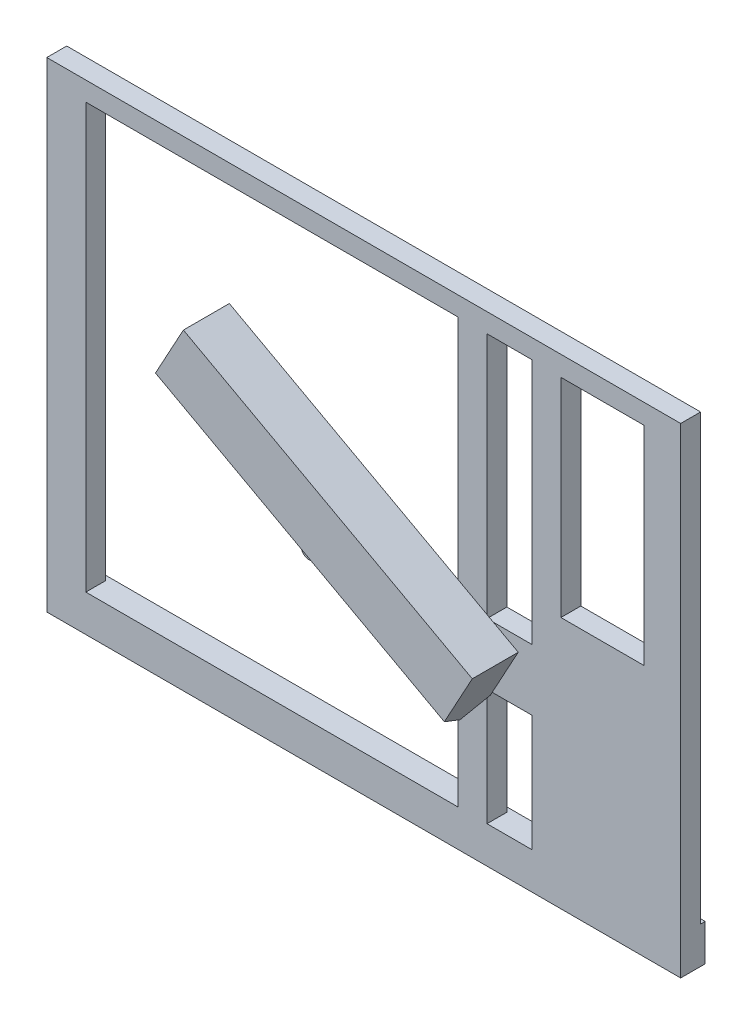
ISO-10303-21;
HEADER;
FILE_DESCRIPTION(('STEP AP214'),'2;1');
FILE_NAME('part.step','',(''),(''),'','','');
FILE_SCHEMA(('AUTOMOTIVE_DESIGN { 1 0 10303 214 1 1 1 1 }'));
ENDSEC;
DATA;
#1=APPLICATION_CONTEXT('core data for automotive mechanical design processes');
#2=APPLICATION_PROTOCOL_DEFINITION('international standard','automotive_design',2000,#1);
#3=PRODUCT_CONTEXT('',#1,'mechanical');
#4=PRODUCT('Part','Part','',(#3));
#5=PRODUCT_RELATED_PRODUCT_CATEGORY('part','',(#4));
#6=PRODUCT_DEFINITION_FORMATION('','',#4);
#7=PRODUCT_DEFINITION_CONTEXT('part definition',#1,'design');
#8=PRODUCT_DEFINITION('design','',#6,#7);
#9=PRODUCT_DEFINITION_SHAPE('','',#8);
#10=(LENGTH_UNIT() NAMED_UNIT(*) SI_UNIT(.MILLI.,.METRE.));
#11=(NAMED_UNIT(*) PLANE_ANGLE_UNIT() SI_UNIT($,.RADIAN.));
#12=(NAMED_UNIT(*) SI_UNIT($,.STERADIAN.) SOLID_ANGLE_UNIT());
#13=UNCERTAINTY_MEASURE_WITH_UNIT(LENGTH_MEASURE(1.E-05),#10,'distance_accuracy_value','');
#14=(GEOMETRIC_REPRESENTATION_CONTEXT(3) GLOBAL_UNCERTAINTY_ASSIGNED_CONTEXT((#13)) GLOBAL_UNIT_ASSIGNED_CONTEXT((#10,
#11,#12)) REPRESENTATION_CONTEXT('',''));
#15=CARTESIAN_POINT('',(0.,0.,0.));
#16=DIRECTION('',(0.,0.,1.));
#17=DIRECTION('',(1.,0.,0.));
#18=AXIS2_PLACEMENT_3D('',#15,#16,#17);
#19=CARTESIAN_POINT('',(-26.1560113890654,1126.92529325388,596.9));
#20=DIRECTION('',(0.,0.,1.));
#21=DIRECTION('',(1.,0.,0.));
#22=AXIS2_PLACEMENT_3D('',#19,#20,#21);
#23=CYLINDRICAL_SURFACE('',#22,6.24634409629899);
#24=DIRECTION('',(0.,0.,1.));
#25=VECTOR('',#24,1.);
#26=CARTESIAN_POINT('',(-20.6723495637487,1123.934262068,596.9));
#27=LINE('',#26,#25);
#28=CARTESIAN_POINT('',(-20.6723495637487,1123.934262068,596.9));
#29=VERTEX_POINT('',#28);
#30=CARTESIAN_POINT('',(-20.6723495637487,1123.934262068,609.6));
#31=VERTEX_POINT('',#30);
#32=EDGE_CURVE('E56',#29,#31,#27,.T.);
#33=ORIENTED_EDGE('',*,*,#32,.T.);
#34=CARTESIAN_POINT('',(-26.1560113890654,1126.92529325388,609.6));
#35=DIRECTION('',(0.,0.,1.));
#36=DIRECTION('',(1.,0.,0.));
#37=AXIS2_PLACEMENT_3D('',#34,#35,#36);
#38=CIRCLE('',#37,6.24634409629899);
#39=CARTESIAN_POINT('',(-24.6180914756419,1120.87123536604,609.6));
#40=VERTEX_POINT('',#39);
#41=EDGE_CURVE('E120',#31,#40,#38,.F.);
#42=ORIENTED_EDGE('',*,*,#41,.T.);
#43=DIRECTION('',(0.,0.,1.));
#44=VECTOR('',#43,1.);
#45=CARTESIAN_POINT('',(-24.6180914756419,1120.87123536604,596.9));
#46=LINE('',#45,#44);
#47=CARTESIAN_POINT('',(-24.6180914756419,1120.87123536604,596.9));
#48=VERTEX_POINT('',#47);
#49=EDGE_CURVE('E12',#48,#40,#46,.T.);
#50=ORIENTED_EDGE('',*,*,#49,.F.);
#51=CARTESIAN_POINT('',(-26.1560113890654,1126.92529325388,596.9));
#52=DIRECTION('',(0.,0.,1.));
#53=DIRECTION('',(1.,0.,0.));
#54=AXIS2_PLACEMENT_3D('',#51,#52,#53);
#55=CIRCLE('',#54,6.24634409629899);
#56=EDGE_CURVE('E69',#29,#48,#55,.F.);
#57=ORIENTED_EDGE('',*,*,#56,.F.);
#58=EDGE_LOOP('',(#33,#42,#50,#57));
#59=FACE_BOUND('',#58,.T.);
#60=ADVANCED_FACE('F53',(#59),#23,.T.);
#61=CARTESIAN_POINT('',(-268.9679684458,1058.79872985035,596.9));
#62=DIRECTION('',(0.246211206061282,-0.969216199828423,0.));
#63=DIRECTION('',(0.969216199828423,0.246211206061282,0.));
#64=AXIS2_PLACEMENT_3D('',#61,#62,#63);
#65=PLANE('',#64);
#66=ORIENTED_EDGE('',*,*,#49,.T.);
#67=DIRECTION('',(0.969216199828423,0.246211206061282,0.));
#68=VECTOR('',#67,1.);
#69=CARTESIAN_POINT('',(-268.9679684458,1058.79872985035,609.6));
#70=LINE('',#69,#68);
#71=CARTESIAN_POINT('',(-81.5535961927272,1106.40783773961,609.6));
#72=VERTEX_POINT('',#71);
#73=EDGE_CURVE('E135',#72,#40,#70,.T.);
#74=ORIENTED_EDGE('',*,*,#73,.F.);
#75=DIRECTION('',(0.,0.,1.));
#76=VECTOR('',#75,1.);
#77=CARTESIAN_POINT('',(-81.5535961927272,1106.40783773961,596.9));
#78=LINE('',#77,#76);
#79=CARTESIAN_POINT('',(-81.5535961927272,1106.40783773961,596.9));
#80=VERTEX_POINT('',#79);
#81=EDGE_CURVE('E61',#80,#72,#78,.T.);
#82=ORIENTED_EDGE('',*,*,#81,.F.);
#83=DIRECTION('',(0.969216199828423,0.246211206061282,0.));
#84=VECTOR('',#83,1.);
#85=CARTESIAN_POINT('',(-268.9679684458,1058.79872985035,596.9));
#86=LINE('',#85,#84);
#87=EDGE_CURVE('E174',#80,#48,#86,.T.);
#88=ORIENTED_EDGE('',*,*,#87,.T.);
#89=EDGE_LOOP('',(#66,#74,#82,#88));
#90=FACE_BOUND('',#89,.T.);
#91=ADVANCED_FACE('F207',(#90),#65,.T.);
#92=CARTESIAN_POINT('',(-89.6834902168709,1138.41135665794,596.9));
#93=DIRECTION('',(0.,0.,1.));
#94=DIRECTION('',(1.,0.,0.));
#95=AXIS2_PLACEMENT_3D('',#92,#93,#94);
#96=CYLINDRICAL_SURFACE('',#95,33.0200000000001);
#97=ORIENTED_EDGE('',*,*,#81,.T.);
#98=CARTESIAN_POINT('',(-89.6834902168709,1138.41135665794,609.6));
#99=DIRECTION('',(0.,0.,1.));
#100=DIRECTION('',(1.,0.,0.));
#101=AXIS2_PLACEMENT_3D('',#98,#99,#100);
#102=CIRCLE('',#101,33.0200000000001);
#103=CARTESIAN_POINT('',(-120.992274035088,1127.91943329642,609.6));
#104=VERTEX_POINT('',#103);
#105=EDGE_CURVE('E152',#104,#72,#102,.T.);
#106=ORIENTED_EDGE('',*,*,#105,.F.);
#107=DIRECTION('',(0.,0.,1.));
#108=VECTOR('',#107,1.);
#109=CARTESIAN_POINT('',(-120.992274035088,1127.91943329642,596.9));
#110=LINE('',#109,#108);
#111=CARTESIAN_POINT('',(-120.992274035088,1127.91943329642,596.9));
#112=VERTEX_POINT('',#111);
#113=EDGE_CURVE('E179',#112,#104,#110,.T.);
#114=ORIENTED_EDGE('',*,*,#113,.F.);
#115=CARTESIAN_POINT('',(-89.6834902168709,1138.41135665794,596.9));
#116=DIRECTION('',(0.,0.,1.));
#117=DIRECTION('',(1.,0.,0.));
#118=AXIS2_PLACEMENT_3D('',#115,#116,#117);
#119=CIRCLE('',#118,33.0200000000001);
#120=EDGE_CURVE('E172',#112,#80,#119,.T.);
#121=ORIENTED_EDGE('',*,*,#120,.T.);
#122=EDGE_LOOP('',(#97,#106,#114,#121));
#123=FACE_BOUND('',#122,.T.);
#124=ADVANCED_FACE('F205',(#123),#96,.T.);
#125=CARTESIAN_POINT('',(231.040410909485,77.4242237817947,596.9));
#126=DIRECTION('',(-0.948176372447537,-0.317744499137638,0.));
#127=DIRECTION('',(0.317744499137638,-0.948176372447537,0.));
#128=AXIS2_PLACEMENT_3D('',#125,#126,#127);
#129=PLANE('',#128);
#130=ORIENTED_EDGE('',*,*,#113,.T.);
#131=DIRECTION('',(0.317744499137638,-0.948176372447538,0.));
#132=VECTOR('',#131,1.);
#133=CARTESIAN_POINT('',(231.040410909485,77.4242237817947,609.6));
#134=LINE('',#133,#132);
#135=CARTESIAN_POINT('',(-139.657813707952,1183.61897725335,609.6));
#136=VERTEX_POINT('',#135);
#137=EDGE_CURVE('E149',#136,#104,#134,.T.);
#138=ORIENTED_EDGE('',*,*,#137,.F.);
#139=DIRECTION('',(0.,0.,1.));
#140=VECTOR('',#139,1.);
#141=CARTESIAN_POINT('',(-139.657813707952,1183.61897725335,596.9));
#142=LINE('',#141,#140);
#143=CARTESIAN_POINT('',(-139.657813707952,1183.61897725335,596.9));
#144=VERTEX_POINT('',#143);
#145=EDGE_CURVE('E181',#144,#136,#142,.T.);
#146=ORIENTED_EDGE('',*,*,#145,.F.);
#147=DIRECTION('',(0.317744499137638,-0.948176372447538,0.));
#148=VECTOR('',#147,1.);
#149=CARTESIAN_POINT('',(231.040410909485,77.4242237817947,596.9));
#150=LINE('',#149,#148);
#151=EDGE_CURVE('E169',#144,#112,#150,.T.);
#152=ORIENTED_EDGE('',*,*,#151,.T.);
#153=EDGE_LOOP('',(#130,#138,#146,#152));
#154=FACE_BOUND('',#153,.T.);
#155=ADVANCED_FACE('F200',(#154),#129,.T.);
#156=CARTESIAN_POINT('',(-133.735177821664,1185.60371872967,596.9));
#157=DIRECTION('',(0.,0.,1.));
#158=DIRECTION('',(1.,0.,0.));
#159=AXIS2_PLACEMENT_3D('',#156,#157,#158);
#160=CYLINDRICAL_SURFACE('',#159,6.2463440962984);
#161=ORIENTED_EDGE('',*,*,#145,.T.);
#162=CARTESIAN_POINT('',(-133.735177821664,1185.60371872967,609.6));
#163=DIRECTION('',(0.,0.,1.));
#164=DIRECTION('',(1.,0.,0.));
#165=AXIS2_PLACEMENT_3D('',#162,#163,#164);
#166=CIRCLE('',#165,6.2463440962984);
#167=CARTESIAN_POINT('',(-139.21883964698,1188.59474991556,609.6));
#168=VERTEX_POINT('',#167);
#169=EDGE_CURVE('E146',#168,#136,#166,.T.);
#170=ORIENTED_EDGE('',*,*,#169,.F.);
#171=DIRECTION('',(0.,0.,1.));
#172=VECTOR('',#171,1.);
#173=CARTESIAN_POINT('',(-139.21883964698,1188.59474991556,596.9));
#174=LINE('',#173,#172);
#175=CARTESIAN_POINT('',(-139.21883964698,1188.59474991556,596.9));
#176=VERTEX_POINT('',#175);
#177=EDGE_CURVE('E183',#176,#168,#174,.T.);
#178=ORIENTED_EDGE('',*,*,#177,.F.);
#179=CARTESIAN_POINT('',(-133.735177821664,1185.60371872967,596.9));
#180=DIRECTION('',(0.,0.,1.));
#181=DIRECTION('',(1.,0.,0.));
#182=AXIS2_PLACEMENT_3D('',#179,#180,#181);
#183=CIRCLE('',#182,6.2463440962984);
#184=EDGE_CURVE('E166',#176,#144,#183,.T.);
#185=ORIENTED_EDGE('',*,*,#184,.T.);
#186=EDGE_LOOP('',(#161,#170,#178,#185));
#187=FACE_BOUND('',#186,.T.);
#188=ADVANCED_FACE('F196',(#187),#160,.T.);
#189=CARTESIAN_POINT('',(-606.955859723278,331.060514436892,596.9));
#190=DIRECTION('',(-0.877899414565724,0.478845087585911,0.));
#191=DIRECTION('',(-0.478845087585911,-0.877899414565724,0.));
#192=AXIS2_PLACEMENT_3D('',#189,#190,#191);
#193=PLANE('',#192);
#194=ORIENTED_EDGE('',*,*,#177,.T.);
#195=DIRECTION('',(-0.478845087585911,-0.877899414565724,0.));
#196=VECTOR('',#195,1.);
#197=CARTESIAN_POINT('',(-606.955859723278,331.060514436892,609.6));
#198=LINE('',#197,#196);
#199=CARTESIAN_POINT('',(-133.137507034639,1199.74407248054,609.6));
#200=VERTEX_POINT('',#199);
#201=EDGE_CURVE('E141',#200,#168,#198,.T.);
#202=ORIENTED_EDGE('',*,*,#201,.F.);
#203=DIRECTION('',(0.,0.,1.));
#204=VECTOR('',#203,1.);
#205=CARTESIAN_POINT('',(-133.137507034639,1199.74407248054,596.9));
#206=LINE('',#205,#204);
#207=CARTESIAN_POINT('',(-133.137507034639,1199.74407248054,596.9));
#208=VERTEX_POINT('',#207);
#209=EDGE_CURVE('E185',#208,#200,#206,.T.);
#210=ORIENTED_EDGE('',*,*,#209,.F.);
#211=DIRECTION('',(-0.478845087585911,-0.877899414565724,0.));
#212=VECTOR('',#211,1.);
#213=CARTESIAN_POINT('',(-606.955859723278,331.060514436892,596.9));
#214=LINE('',#213,#212);
#215=EDGE_CURVE('E163',#208,#176,#214,.T.);
#216=ORIENTED_EDGE('',*,*,#215,.T.);
#217=EDGE_LOOP('',(#194,#202,#210,#216));
#218=FACE_BOUND('',#217,.T.);
#219=ADVANCED_FACE('F192',(#218),#193,.T.);
#220=CARTESIAN_POINT('',(473.818352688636,868.683558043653,596.9));
#221=DIRECTION('',(-0.478845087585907,-0.877899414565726,0.));
#222=DIRECTION('',(0.877899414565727,-0.478845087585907,0.));
#223=AXIS2_PLACEMENT_3D('',#220,#221,#222);
#224=PLANE('',#223);
#225=ORIENTED_EDGE('',*,*,#209,.T.);
#226=DIRECTION('',(0.877899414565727,-0.478845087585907,0.));
#227=VECTOR('',#226,1.);
#228=CARTESIAN_POINT('',(473.818352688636,868.683558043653,609.6));
#229=LINE('',#228,#227);
#230=CARTESIAN_POINT('',(-14.5910169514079,1135.08358463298,609.6));
#231=VERTEX_POINT('',#230);
#232=EDGE_CURVE('E139',#200,#231,#229,.T.);
#233=ORIENTED_EDGE('',*,*,#232,.T.);
#234=DIRECTION('',(0.,0.,1.));
#235=VECTOR('',#234,1.);
#236=CARTESIAN_POINT('',(-14.5910169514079,1135.08358463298,596.9));
#237=LINE('',#236,#235);
#238=CARTESIAN_POINT('',(-14.5910169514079,1135.08358463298,596.9));
#239=VERTEX_POINT('',#238);
#240=EDGE_CURVE('E124',#239,#231,#237,.T.);
#241=ORIENTED_EDGE('',*,*,#240,.F.);
#242=DIRECTION('',(0.877899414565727,-0.478845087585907,0.));
#243=VECTOR('',#242,1.);
#244=CARTESIAN_POINT('',(473.818352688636,868.683558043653,596.9));
#245=LINE('',#244,#243);
#246=EDGE_CURVE('E161',#208,#239,#245,.T.);
#247=ORIENTED_EDGE('',*,*,#246,.F.);
#248=EDGE_LOOP('',(#225,#233,#241,#247));
#249=FACE_BOUND('',#248,.T.);
#250=ADVANCED_FACE('F189',(#249),#224,.F.);
#251=CARTESIAN_POINT('',(-488.409369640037,266.400026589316,596.9));
#252=DIRECTION('',(-0.877899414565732,0.478845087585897,0.));
#253=DIRECTION('',(-0.478845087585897,-0.877899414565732,0.));
#254=AXIS2_PLACEMENT_3D('',#251,#252,#253);
#255=PLANE('',#254);
#256=ORIENTED_EDGE('',*,*,#240,.T.);
#257=DIRECTION('',(-0.478845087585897,-0.877899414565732,0.));
#258=VECTOR('',#257,1.);
#259=CARTESIAN_POINT('',(-488.409369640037,266.400026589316,609.6));
#260=LINE('',#259,#258);
#261=EDGE_CURVE('E132',#231,#31,#260,.T.);
#262=ORIENTED_EDGE('',*,*,#261,.T.);
#263=ORIENTED_EDGE('',*,*,#32,.F.);
#264=DIRECTION('',(-0.478845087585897,-0.877899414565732,0.));
#265=VECTOR('',#264,1.);
#266=CARTESIAN_POINT('',(-488.409369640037,266.400026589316,596.9));
#267=LINE('',#266,#265);
#268=EDGE_CURVE('E159',#239,#29,#267,.T.);
#269=ORIENTED_EDGE('',*,*,#268,.F.);
#270=EDGE_LOOP('',(#256,#262,#263,#269));
#271=FACE_BOUND('',#270,.T.);
#272=ADVANCED_FACE('F137',(#271),#255,.F.);
#273=CARTESIAN_POINT('',(-89.6834902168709,1138.41135665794,596.9));
#274=DIRECTION('',(0.,0.,1.));
#275=DIRECTION('',(1.,0.,0.));
#276=AXIS2_PLACEMENT_3D('',#273,#274,#275);
#277=CYLINDRICAL_SURFACE('',#276,19.0499999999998);
#278=CARTESIAN_POINT('',(-89.6834902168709,1138.41135665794,596.9));
#279=DIRECTION('',(0.,0.,1.));
#280=DIRECTION('',(1.,0.,0.));
#281=AXIS2_PLACEMENT_3D('',#278,#279,#280);
#282=CIRCLE('',#281,19.0499999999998);
#283=CARTESIAN_POINT('',(-70.633490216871,1138.41135665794,596.9));
#284=VERTEX_POINT('',#283);
#285=EDGE_CURVE('E125',#284,#284,#282,.T.);
#286=ORIENTED_EDGE('',*,*,#285,.F.);
#287=EDGE_LOOP('',(#286));
#288=FACE_BOUND('',#287,.T.);
#289=CARTESIAN_POINT('',(-89.6834902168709,1138.41135665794,609.6));
#290=DIRECTION('',(0.,0.,1.));
#291=DIRECTION('',(1.,0.,0.));
#292=AXIS2_PLACEMENT_3D('',#289,#290,#291);
#293=CIRCLE('',#292,19.0499999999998);
#294=CARTESIAN_POINT('',(-70.633490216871,1138.41135665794,609.6));
#295=VERTEX_POINT('',#294);
#296=EDGE_CURVE('E155',#295,#295,#293,.T.);
#297=ORIENTED_EDGE('',*,*,#296,.T.);
#298=EDGE_LOOP('',(#297));
#299=FACE_BOUND('',#298,.T.);
#300=ADVANCED_FACE('F216',(#288,#299),#277,.F.);
#301=CARTESIAN_POINT('',(0.,0.,596.9));
#302=DIRECTION('',(0.,0.,1.));
#303=DIRECTION('',(1.,0.,0.));
#304=AXIS2_PLACEMENT_3D('',#301,#302,#303);
#305=PLANE('',#304);
#306=ORIENTED_EDGE('',*,*,#56,.T.);
#307=ORIENTED_EDGE('',*,*,#87,.F.);
#308=ORIENTED_EDGE('',*,*,#120,.F.);
#309=ORIENTED_EDGE('',*,*,#151,.F.);
#310=ORIENTED_EDGE('',*,*,#184,.F.);
#311=ORIENTED_EDGE('',*,*,#215,.F.);
#312=ORIENTED_EDGE('',*,*,#246,.T.);
#313=ORIENTED_EDGE('',*,*,#268,.T.);
#314=EDGE_LOOP('',(#306,#307,#308,#309,#310,#311,#312,#313));
#315=FACE_BOUND('',#314,.T.);
#316=ORIENTED_EDGE('',*,*,#285,.T.);
#317=EDGE_LOOP('',(#316));
#318=FACE_BOUND('',#317,.T.);
#319=ADVANCED_FACE('F202',(#315,#318),#305,.F.);
#320=CARTESIAN_POINT('',(0.,0.,609.6));
#321=DIRECTION('',(0.,0.,1.));
#322=DIRECTION('',(1.,0.,0.));
#323=AXIS2_PLACEMENT_3D('',#320,#321,#322);
#324=PLANE('',#323);
#325=ORIENTED_EDGE('',*,*,#41,.F.);
#326=ORIENTED_EDGE('',*,*,#261,.F.);
#327=ORIENTED_EDGE('',*,*,#232,.F.);
#328=ORIENTED_EDGE('',*,*,#201,.T.);
#329=ORIENTED_EDGE('',*,*,#169,.T.);
#330=ORIENTED_EDGE('',*,*,#137,.T.);
#331=ORIENTED_EDGE('',*,*,#105,.T.);
#332=ORIENTED_EDGE('',*,*,#73,.T.);
#333=EDGE_LOOP('',(#325,#326,#327,#328,#329,#330,#331,#332));
#334=FACE_BOUND('',#333,.T.);
#335=ORIENTED_EDGE('',*,*,#296,.F.);
#336=EDGE_LOOP('',(#335));
#337=FACE_BOUND('',#336,.T.);
#338=ADVANCED_FACE('F129',(#334,#337),#324,.T.);
#339=CLOSED_SHELL('',(#60,#91,#124,#155,#188,#219,#250,#272,#300,#319,#338));
#340=MANIFOLD_SOLID_BREP('B2_NOT_SHOWN',#339);
#341=CARTESIAN_POINT('',(-521.836401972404,1758.95,698.5));
#342=DIRECTION('',(-0.877899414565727,0.478845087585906,0.));
#343=DIRECTION('',(-0.478845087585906,-0.877899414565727,0.));
#344=AXIS2_PLACEMENT_3D('',#341,#342,#343);
#345=PLANE('',#344);
#346=DIRECTION('',(-0.264691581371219,-0.485277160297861,0.833333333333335));
#347=VECTOR('',#346,1.);
#348=CARTESIAN_POINT('',(-637.534136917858,1546.83343786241,508.));
#349=LINE('',#348,#347);
#350=CARTESIAN_POINT('',(-637.534136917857,1546.83343786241,508.));
#351=VERTEX_POINT('',#350);
#352=CARTESIAN_POINT('',(-667.788384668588,1491.36625844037,603.25));
#353=VERTEX_POINT('',#352);
#354=EDGE_CURVE('E325',#351,#353,#349,.T.);
#355=ORIENTED_EDGE('',*,*,#354,.T.);
#356=DIRECTION('',(0.264691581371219,0.485277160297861,0.833333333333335));
#357=VECTOR('',#356,1.);
#358=CARTESIAN_POINT('',(-667.788384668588,1491.36625844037,603.25));
#359=LINE('',#358,#357);
#360=CARTESIAN_POINT('',(-637.534136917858,1546.83343786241,698.5));
#361=VERTEX_POINT('',#360);
#362=EDGE_CURVE('E377',#353,#361,#359,.T.);
#363=ORIENTED_EDGE('',*,*,#362,.T.);
#364=DIRECTION('',(0.478845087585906,0.877899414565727,0.));
#365=VECTOR('',#364,1.);
#366=CARTESIAN_POINT('',(-521.836401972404,1758.95,698.5));
#367=LINE('',#366,#365);
#368=CARTESIAN_POINT('',(-521.836401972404,1758.95,698.5));
#369=VERTEX_POINT('',#368);
#370=EDGE_CURVE('E360',#361,#369,#367,.T.);
#371=ORIENTED_EDGE('',*,*,#370,.T.);
#372=DIRECTION('',(0.,0.,-1.));
#373=VECTOR('',#372,1.);
#374=CARTESIAN_POINT('',(-521.836401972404,1758.95,698.5));
#375=LINE('',#374,#373);
#376=CARTESIAN_POINT('',(-521.836401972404,1758.95,508.));
#377=VERTEX_POINT('',#376);
#378=EDGE_CURVE('E314',#369,#377,#375,.T.);
#379=ORIENTED_EDGE('',*,*,#378,.T.);
#380=DIRECTION('',(0.478845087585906,0.877899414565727,0.));
#381=VECTOR('',#380,1.);
#382=CARTESIAN_POINT('',(-521.836401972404,1758.95,508.));
#383=LINE('',#382,#381);
#384=EDGE_CURVE('E364',#351,#377,#383,.T.);
#385=ORIENTED_EDGE('',*,*,#384,.F.);
#386=EDGE_LOOP('',(#355,#363,#371,#379,#385));
#387=FACE_BOUND('',#386,.T.);
#388=ADVANCED_FACE('F311',(#387),#345,.T.);
#389=CARTESIAN_POINT('',(529.705942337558,838.2,698.5));
#390=DIRECTION('',(0.877899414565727,-0.478845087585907,0.));
#391=DIRECTION('',(0.478845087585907,0.877899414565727,0.));
#392=AXIS2_PLACEMENT_3D('',#389,#390,#391);
#393=PLANE('',#392);
#394=DIRECTION('',(-0.264691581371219,-0.485277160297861,-0.833333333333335));
#395=VECTOR('',#394,1.);
#396=CARTESIAN_POINT('',(529.705942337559,838.2,603.25));
#397=LINE('',#396,#395);
#398=CARTESIAN_POINT('',(559.960190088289,893.667179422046,698.5));
#399=VERTEX_POINT('',#398);
#400=CARTESIAN_POINT('',(529.705942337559,838.2,603.25));
#401=VERTEX_POINT('',#400);
#402=EDGE_CURVE('E378',#399,#401,#397,.T.);
#403=ORIENTED_EDGE('',*,*,#402,.T.);
#404=DIRECTION('',(0.264691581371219,0.485277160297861,-0.833333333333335));
#405=VECTOR('',#404,1.);
#406=CARTESIAN_POINT('',(559.960190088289,893.667179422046,508.));
#407=LINE('',#406,#405);
#408=CARTESIAN_POINT('',(559.960190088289,893.667179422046,508.));
#409=VERTEX_POINT('',#408);
#410=EDGE_CURVE('E358',#401,#409,#407,.T.);
#411=ORIENTED_EDGE('',*,*,#410,.T.);
#412=DIRECTION('',(-0.478845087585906,-0.877899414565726,0.));
#413=VECTOR('',#412,1.);
#414=CARTESIAN_POINT('',(529.705942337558,838.2,508.));
#415=LINE('',#414,#413);
#416=CARTESIAN_POINT('',(675.657925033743,1105.78374155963,508.));
#417=VERTEX_POINT('',#416);
#418=EDGE_CURVE('E353',#417,#409,#415,.T.);
#419=ORIENTED_EDGE('',*,*,#418,.F.);
#420=DIRECTION('',(0.,0.,-1.));
#421=VECTOR('',#420,1.);
#422=CARTESIAN_POINT('',(675.657925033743,1105.78374155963,698.5));
#423=LINE('',#422,#421);
#424=CARTESIAN_POINT('',(675.657925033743,1105.78374155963,698.5));
#425=VERTEX_POINT('',#424);
#426=EDGE_CURVE('E51',#425,#417,#423,.T.);
#427=ORIENTED_EDGE('',*,*,#426,.F.);
#428=DIRECTION('',(-0.478845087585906,-0.877899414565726,0.));
#429=VECTOR('',#428,1.);
#430=CARTESIAN_POINT('',(529.705942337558,838.2,698.5));
#431=LINE('',#430,#429);
#432=EDGE_CURVE('E369',#425,#399,#431,.T.);
#433=ORIENTED_EDGE('',*,*,#432,.T.);
#434=EDGE_LOOP('',(#403,#411,#419,#427,#433));
#435=FACE_BOUND('',#434,.T.);
#436=ADVANCED_FACE('F355',(#435),#393,.T.);
#437=CARTESIAN_POINT('',(675.657925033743,1105.78374155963,698.5));
#438=DIRECTION('',(0.478845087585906,0.877899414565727,0.));
#439=DIRECTION('',(-0.877899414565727,0.478845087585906,0.));
#440=AXIS2_PLACEMENT_3D('',#437,#438,#439);
#441=PLANE('',#440);
#442=DIRECTION('',(0.877899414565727,-0.478845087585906,0.));
#443=VECTOR('',#442,1.);
#444=CARTESIAN_POINT('',(675.657925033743,1105.78374155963,508.));
#445=LINE('',#444,#443);
#446=EDGE_CURVE('E348',#377,#417,#445,.T.);
#447=ORIENTED_EDGE('',*,*,#446,.F.);
#448=ORIENTED_EDGE('',*,*,#378,.F.);
#449=DIRECTION('',(0.877899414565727,-0.478845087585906,0.));
#450=VECTOR('',#449,1.);
#451=CARTESIAN_POINT('',(675.657925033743,1105.78374155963,698.5));
#452=LINE('',#451,#450);
#453=EDGE_CURVE('E350',#369,#425,#452,.T.);
#454=ORIENTED_EDGE('',*,*,#453,.T.);
#455=ORIENTED_EDGE('',*,*,#426,.T.);
#456=EDGE_LOOP('',(#447,#448,#454,#455));
#457=FACE_BOUND('',#456,.T.);
#458=ADVANCED_FACE('F345',(#457),#441,.T.);
#459=CARTESIAN_POINT('',(0.,0.,698.5));
#460=DIRECTION('',(0.,0.,1.));
#461=DIRECTION('',(1.,0.,0.));
#462=AXIS2_PLACEMENT_3D('',#459,#460,#461);
#463=PLANE('',#462);
#464=DIRECTION('',(-0.877899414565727,0.478845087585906,0.));
#465=VECTOR('',#464,1.);
#466=CARTESIAN_POINT('',(572.05488279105,887.070200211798,698.5));
#467=LINE('',#466,#465);
#468=EDGE_CURVE('E379',#399,#361,#467,.T.);
#469=ORIENTED_EDGE('',*,*,#468,.F.);
#470=ORIENTED_EDGE('',*,*,#432,.F.);
#471=ORIENTED_EDGE('',*,*,#453,.F.);
#472=ORIENTED_EDGE('',*,*,#370,.F.);
#473=EDGE_LOOP('',(#469,#470,#471,#472));
#474=FACE_BOUND('',#473,.T.);
#475=ADVANCED_FACE('F402',(#474),#463,.T.);
#476=CARTESIAN_POINT('',(0.,0.,508.));
#477=DIRECTION('',(0.,0.,1.));
#478=DIRECTION('',(1.,0.,0.));
#479=AXIS2_PLACEMENT_3D('',#476,#477,#478);
#480=PLANE('',#479);
#481=ORIENTED_EDGE('',*,*,#418,.T.);
#482=DIRECTION('',(-0.877899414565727,0.478845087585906,0.));
#483=VECTOR('',#482,1.);
#484=CARTESIAN_POINT('',(572.05488279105,887.070200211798,508.));
#485=LINE('',#484,#483);
#486=EDGE_CURVE('E373',#409,#351,#485,.T.);
#487=ORIENTED_EDGE('',*,*,#486,.T.);
#488=ORIENTED_EDGE('',*,*,#384,.T.);
#489=ORIENTED_EDGE('',*,*,#446,.T.);
#490=EDGE_LOOP('',(#481,#487,#488,#489));
#491=FACE_BOUND('',#490,.T.);
#492=ADVANCED_FACE('F362',(#491),#480,.F.);
#493=CARTESIAN_POINT('',(541.80063504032,831.603020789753,603.25));
#494=DIRECTION('',(0.399037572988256,0.731582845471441,-0.552770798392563));
#495=DIRECTION('',(0.,0.602846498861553,0.797857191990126));
#496=AXIS2_PLACEMENT_3D('',#493,#494,#495);
#497=PLANE('',#496);
#498=ORIENTED_EDGE('',*,*,#468,.T.);
#499=ORIENTED_EDGE('',*,*,#362,.F.);
#500=DIRECTION('',(-0.877899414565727,0.478845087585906,0.));
#501=VECTOR('',#500,1.);
#502=CARTESIAN_POINT('',(541.80063504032,831.603020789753,603.25));
#503=LINE('',#502,#501);
#504=EDGE_CURVE('E375',#401,#353,#503,.T.);
#505=ORIENTED_EDGE('',*,*,#504,.F.);
#506=ORIENTED_EDGE('',*,*,#402,.F.);
#507=EDGE_LOOP('',(#498,#499,#505,#506));
#508=FACE_BOUND('',#507,.T.);
#509=ADVANCED_FACE('F400',(#508),#497,.F.);
#510=CARTESIAN_POINT('',(572.05488279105,887.070200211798,508.));
#511=DIRECTION('',(0.399037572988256,0.731582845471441,0.552770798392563));
#512=DIRECTION('',(0.,-0.602846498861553,0.797857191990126));
#513=AXIS2_PLACEMENT_3D('',#510,#511,#512);
#514=PLANE('',#513);
#515=ORIENTED_EDGE('',*,*,#504,.T.);
#516=ORIENTED_EDGE('',*,*,#354,.F.);
#517=ORIENTED_EDGE('',*,*,#486,.F.);
#518=ORIENTED_EDGE('',*,*,#410,.F.);
#519=EDGE_LOOP('',(#515,#516,#517,#518));
#520=FACE_BOUND('',#519,.T.);
#521=ADVANCED_FACE('F440',(#520),#514,.F.);
#522=CLOSED_SHELL('',(#388,#436,#458,#475,#492,#509,#521));
#523=MANIFOLD_SOLID_BREP('B6_NOT_SHOWN',#522);
#524=CARTESIAN_POINT('',(0.,0.,82.55));
#525=DIRECTION('',(0.,0.,1.));
#526=DIRECTION('',(1.,0.,0.));
#527=AXIS2_PLACEMENT_3D('',#524,#525,#526);
#528=PLANE('',#527);
#529=DIRECTION('',(0.,1.,0.));
#530=VECTOR('',#529,1.);
#531=CARTESIAN_POINT('',(306.3875,0.,82.55));
#532=LINE('',#531,#530);
#533=CARTESIAN_POINT('',(306.3875,0.,82.55));
#534=VERTEX_POINT('',#533);
#535=CARTESIAN_POINT('',(306.3875,482.6,82.55));
#536=VERTEX_POINT('',#535);
#537=EDGE_CURVE('E680',#534,#536,#532,.T.);
#538=ORIENTED_EDGE('',*,*,#537,.F.);
#539=DIRECTION('',(1.,0.,0.));
#540=VECTOR('',#539,1.);
#541=CARTESIAN_POINT('',(120.65,0.,82.55));
#542=LINE('',#541,#540);
#543=CARTESIAN_POINT('',(120.65,0.,82.55));
#544=VERTEX_POINT('',#543);
#545=EDGE_CURVE('E677',#544,#534,#542,.T.);
#546=ORIENTED_EDGE('',*,*,#545,.F.);
#547=DIRECTION('',(0.,-1.,0.));
#548=VECTOR('',#547,1.);
#549=CARTESIAN_POINT('',(120.65,482.6,82.55));
#550=LINE('',#549,#548);
#551=CARTESIAN_POINT('',(120.65,482.6,82.55));
#552=VERTEX_POINT('',#551);
#553=EDGE_CURVE('E674',#552,#544,#550,.T.);
#554=ORIENTED_EDGE('',*,*,#553,.F.);
#555=DIRECTION('',(-1.,0.,0.));
#556=VECTOR('',#555,1.);
#557=CARTESIAN_POINT('',(306.3875,482.6,82.55));
#558=LINE('',#557,#556);
#559=EDGE_CURVE('E672',#536,#552,#558,.T.);
#560=ORIENTED_EDGE('',*,*,#559,.F.);
#561=EDGE_LOOP('',(#538,#546,#554,#560));
#562=FACE_BOUND('',#561,.T.);
#563=DIRECTION('',(0.,1.,0.));
#564=VECTOR('',#563,1.);
#565=CARTESIAN_POINT('',(0.,1758.95,82.55));
#566=LINE('',#565,#564);
#567=CARTESIAN_POINT('',(0.,0.,82.55));
#568=VERTEX_POINT('',#567);
#569=CARTESIAN_POINT('',(0.,1758.95,82.55));
#570=VERTEX_POINT('',#569);
#571=EDGE_CURVE('E781',#568,#570,#566,.T.);
#572=ORIENTED_EDGE('',*,*,#571,.F.);
#573=DIRECTION('',(1.,0.,0.));
#574=VECTOR('',#573,1.);
#575=CARTESIAN_POINT('',(0.,0.,82.55));
#576=LINE('',#575,#574);
#577=CARTESIAN_POINT('',(-1542.26280991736,0.,82.55));
#578=VERTEX_POINT('',#577);
#579=EDGE_CURVE('E778',#578,#568,#576,.T.);
#580=ORIENTED_EDGE('',*,*,#579,.F.);
#581=DIRECTION('',(0.,-1.,0.));
#582=VECTOR('',#581,1.);
#583=CARTESIAN_POINT('',(-1542.26280991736,0.,82.55));
#584=LINE('',#583,#582);
#585=CARTESIAN_POINT('',(-1542.26280991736,1758.95,82.55));
#586=VERTEX_POINT('',#585);
#587=EDGE_CURVE('E792',#586,#578,#584,.T.);
#588=ORIENTED_EDGE('',*,*,#587,.F.);
#589=DIRECTION('',(-1.,0.,0.));
#590=VECTOR('',#589,1.);
#591=CARTESIAN_POINT('',(-1542.26280991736,1758.95,82.55));
#592=LINE('',#591,#590);
#593=EDGE_CURVE('E795',#570,#586,#592,.T.);
#594=ORIENTED_EDGE('',*,*,#593,.F.);
#595=EDGE_LOOP('',(#572,#580,#588,#594));
#596=FACE_BOUND('',#595,.T.);
#597=DIRECTION('',(0.,1.,0.));
#598=VECTOR('',#597,1.);
#599=CARTESIAN_POINT('',(923.54452479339,-152.4,82.55));
#600=LINE('',#599,#598);
#601=CARTESIAN_POINT('',(923.54452479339,-152.4,82.55));
#602=VERTEX_POINT('',#601);
#603=CARTESIAN_POINT('',(923.54452479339,1838.325,82.55));
#604=VERTEX_POINT('',#603);
#605=EDGE_CURVE('E730',#602,#604,#600,.T.);
#606=ORIENTED_EDGE('',*,*,#605,.T.);
#607=DIRECTION('',(-1.,0.,0.));
#608=VECTOR('',#607,1.);
#609=CARTESIAN_POINT('',(923.54452479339,1838.325,82.55));
#610=LINE('',#609,#608);
#611=CARTESIAN_POINT('',(-1703.95165289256,1838.325,82.55));
#612=VERTEX_POINT('',#611);
#613=EDGE_CURVE('E724',#604,#612,#610,.T.);
#614=ORIENTED_EDGE('',*,*,#613,.T.);
#615=DIRECTION('',(0.,-1.,0.));
#616=VECTOR('',#615,1.);
#617=CARTESIAN_POINT('',(-1703.95165289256,1838.325,82.55));
#618=LINE('',#617,#616);
#619=CARTESIAN_POINT('',(-1703.95165289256,-152.4,82.55));
#620=VERTEX_POINT('',#619);
#621=EDGE_CURVE('E729',#612,#620,#618,.T.);
#622=ORIENTED_EDGE('',*,*,#621,.T.);
#623=DIRECTION('',(1.,0.,0.));
#624=VECTOR('',#623,1.);
#625=CARTESIAN_POINT('',(688.214049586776,-152.4,82.55));
#626=LINE('',#625,#624);
#627=EDGE_CURVE('E742',#620,#602,#626,.T.);
#628=ORIENTED_EDGE('',*,*,#627,.T.);
#629=EDGE_LOOP('',(#606,#614,#622,#628));
#630=FACE_BOUND('',#629,.T.);
#631=DIRECTION('',(0.,-1.,0.));
#632=VECTOR('',#631,1.);
#633=CARTESIAN_POINT('',(120.65,1758.95,82.55));
#634=LINE('',#633,#632);
#635=CARTESIAN_POINT('',(120.65,1758.95,82.55));
#636=VERTEX_POINT('',#635);
#637=CARTESIAN_POINT('',(120.65,736.6,82.55));
#638=VERTEX_POINT('',#637);
#639=EDGE_CURVE('E703',#636,#638,#634,.T.);
#640=ORIENTED_EDGE('',*,*,#639,.F.);
#641=DIRECTION('',(-1.,0.,0.));
#642=VECTOR('',#641,1.);
#643=CARTESIAN_POINT('',(306.3875,1758.95,82.55));
#644=LINE('',#643,#642);
#645=CARTESIAN_POINT('',(306.3875,1758.95,82.55));
#646=VERTEX_POINT('',#645);
#647=EDGE_CURVE('E701',#646,#636,#644,.T.);
#648=ORIENTED_EDGE('',*,*,#647,.F.);
#649=DIRECTION('',(0.,1.,0.));
#650=VECTOR('',#649,1.);
#651=CARTESIAN_POINT('',(306.3875,736.6,82.55));
#652=LINE('',#651,#650);
#653=CARTESIAN_POINT('',(306.3875,736.6,82.55));
#654=VERTEX_POINT('',#653);
#655=EDGE_CURVE('E709',#654,#646,#652,.T.);
#656=ORIENTED_EDGE('',*,*,#655,.F.);
#657=DIRECTION('',(1.,0.,0.));
#658=VECTOR('',#657,1.);
#659=CARTESIAN_POINT('',(120.65,736.6,82.55));
#660=LINE('',#659,#658);
#661=EDGE_CURVE('E706',#638,#654,#660,.T.);
#662=ORIENTED_EDGE('',*,*,#661,.F.);
#663=EDGE_LOOP('',(#640,#648,#656,#662));
#664=FACE_BOUND('',#663,.T.);
#665=DIRECTION('',(1.,0.,0.));
#666=VECTOR('',#665,1.);
#667=CARTESIAN_POINT('',(427.0375,893.434504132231,82.55));
#668=LINE('',#667,#666);
#669=CARTESIAN_POINT('',(427.0375,893.434504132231,82.55));
#670=VERTEX_POINT('',#669);
#671=CARTESIAN_POINT('',(771.144524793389,893.434504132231,82.55));
#672=VERTEX_POINT('',#671);
#673=EDGE_CURVE('E647',#670,#672,#668,.T.);
#674=ORIENTED_EDGE('',*,*,#673,.F.);
#675=DIRECTION('',(0.,-1.,0.));
#676=VECTOR('',#675,1.);
#677=CARTESIAN_POINT('',(427.0375,1755.775,82.55));
#678=LINE('',#677,#676);
#679=CARTESIAN_POINT('',(427.0375,1755.775,82.55));
#680=VERTEX_POINT('',#679);
#681=EDGE_CURVE('E645',#680,#670,#678,.T.);
#682=ORIENTED_EDGE('',*,*,#681,.F.);
#683=DIRECTION('',(-1.,0.,0.));
#684=VECTOR('',#683,1.);
#685=CARTESIAN_POINT('',(427.0375,1755.775,82.55));
#686=LINE('',#685,#684);
#687=CARTESIAN_POINT('',(771.144524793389,1755.775,82.55));
#688=VERTEX_POINT('',#687);
#689=EDGE_CURVE('E652',#688,#680,#686,.T.);
#690=ORIENTED_EDGE('',*,*,#689,.F.);
#691=DIRECTION('',(0.,1.,0.));
#692=VECTOR('',#691,1.);
#693=CARTESIAN_POINT('',(771.144524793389,1755.775,82.55));
#694=LINE('',#693,#692);
#695=EDGE_CURVE('E650',#672,#688,#694,.T.);
#696=ORIENTED_EDGE('',*,*,#695,.F.);
#697=EDGE_LOOP('',(#674,#682,#690,#696));
#698=FACE_BOUND('',#697,.T.);
#699=ADVANCED_FACE('F462',(#562,#596,#630,#664,#698),#528,.T.);
#700=CARTESIAN_POINT('',(0.,0.,0.));
#701=DIRECTION('',(0.,0.,1.));
#702=DIRECTION('',(1.,0.,0.));
#703=AXIS2_PLACEMENT_3D('',#700,#701,#702);
#704=PLANE('',#703);
#705=DIRECTION('',(0.,1.,0.));
#706=VECTOR('',#705,1.);
#707=CARTESIAN_POINT('',(923.54452479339,-152.4,0.));
#708=LINE('',#707,#706);
#709=CARTESIAN_POINT('',(923.54452479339,0.,0.));
#710=VERTEX_POINT('',#709);
#711=CARTESIAN_POINT('',(923.54452479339,1838.325,0.));
#712=VERTEX_POINT('',#711);
#713=EDGE_CURVE('E734',#710,#712,#708,.T.);
#714=ORIENTED_EDGE('',*,*,#713,.F.);
#715=DIRECTION('',(-1.,0.,0.));
#716=VECTOR('',#715,1.);
#717=CARTESIAN_POINT('',(0.,0.,0.));
#718=LINE('',#717,#716);
#719=CARTESIAN_POINT('',(306.3875,0.,0.));
#720=VERTEX_POINT('',#719);
#721=EDGE_CURVE('E619',#710,#720,#718,.T.);
#722=ORIENTED_EDGE('',*,*,#721,.T.);
#723=DIRECTION('',(0.,1.,0.));
#724=VECTOR('',#723,1.);
#725=CARTESIAN_POINT('',(306.3875,0.,0.));
#726=LINE('',#725,#724);
#727=CARTESIAN_POINT('',(306.3875,482.6,0.));
#728=VERTEX_POINT('',#727);
#729=EDGE_CURVE('E675',#720,#728,#726,.T.);
#730=ORIENTED_EDGE('',*,*,#729,.T.);
#731=DIRECTION('',(-1.,0.,0.));
#732=VECTOR('',#731,1.);
#733=CARTESIAN_POINT('',(306.3875,482.6,0.));
#734=LINE('',#733,#732);
#735=CARTESIAN_POINT('',(120.65,482.6,0.));
#736=VERTEX_POINT('',#735);
#737=EDGE_CURVE('E671',#728,#736,#734,.T.);
#738=ORIENTED_EDGE('',*,*,#737,.T.);
#739=DIRECTION('',(0.,-1.,0.));
#740=VECTOR('',#739,1.);
#741=CARTESIAN_POINT('',(120.65,482.6,0.));
#742=LINE('',#741,#740);
#743=CARTESIAN_POINT('',(120.65,0.,0.));
#744=VERTEX_POINT('',#743);
#745=EDGE_CURVE('E685',#736,#744,#742,.T.);
#746=ORIENTED_EDGE('',*,*,#745,.T.);
#747=CARTESIAN_POINT('',(0.,0.,0.));
#748=VERTEX_POINT('',#747);
#749=EDGE_CURVE('E644',#744,#748,#718,.T.);
#750=ORIENTED_EDGE('',*,*,#749,.T.);
#751=DIRECTION('',(0.,1.,0.));
#752=VECTOR('',#751,1.);
#753=CARTESIAN_POINT('',(0.,1758.95,0.));
#754=LINE('',#753,#752);
#755=CARTESIAN_POINT('',(0.,1758.95,0.));
#756=VERTEX_POINT('',#755);
#757=EDGE_CURVE('E785',#748,#756,#754,.T.);
#758=ORIENTED_EDGE('',*,*,#757,.T.);
#759=DIRECTION('',(-1.,0.,0.));
#760=VECTOR('',#759,1.);
#761=CARTESIAN_POINT('',(-1542.26280991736,1758.95,0.));
#762=LINE('',#761,#760);
#763=CARTESIAN_POINT('',(-1542.26280991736,1758.95,0.));
#764=VERTEX_POINT('',#763);
#765=EDGE_CURVE('E782',#756,#764,#762,.T.);
#766=ORIENTED_EDGE('',*,*,#765,.T.);
#767=DIRECTION('',(0.,-1.,0.));
#768=VECTOR('',#767,1.);
#769=CARTESIAN_POINT('',(-1542.26280991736,0.,0.));
#770=LINE('',#769,#768);
#771=CARTESIAN_POINT('',(-1542.26280991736,0.,0.));
#772=VERTEX_POINT('',#771);
#773=EDGE_CURVE('E779',#764,#772,#770,.T.);
#774=ORIENTED_EDGE('',*,*,#773,.T.);
#775=CARTESIAN_POINT('',(-1703.95165289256,0.,0.));
#776=VERTEX_POINT('',#775);
#777=EDGE_CURVE('E642',#772,#776,#718,.T.);
#778=ORIENTED_EDGE('',*,*,#777,.T.);
#779=DIRECTION('',(0.,-1.,0.));
#780=VECTOR('',#779,1.);
#781=CARTESIAN_POINT('',(-1703.95165289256,1838.325,0.));
#782=LINE('',#781,#780);
#783=CARTESIAN_POINT('',(-1703.95165289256,1838.325,0.));
#784=VERTEX_POINT('',#783);
#785=EDGE_CURVE('E739',#784,#776,#782,.T.);
#786=ORIENTED_EDGE('',*,*,#785,.F.);
#787=DIRECTION('',(-1.,0.,0.));
#788=VECTOR('',#787,1.);
#789=CARTESIAN_POINT('',(923.54452479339,1838.325,0.));
#790=LINE('',#789,#788);
#791=EDGE_CURVE('E736',#712,#784,#790,.T.);
#792=ORIENTED_EDGE('',*,*,#791,.F.);
#793=EDGE_LOOP('',(#714,#722,#730,#738,#746,#750,#758,#766,#774,#778,#786,#792));
#794=FACE_BOUND('',#793,.T.);
#795=DIRECTION('',(-1.,0.,0.));
#796=VECTOR('',#795,1.);
#797=CARTESIAN_POINT('',(306.3875,1758.95,0.));
#798=LINE('',#797,#796);
#799=CARTESIAN_POINT('',(306.3875,1758.95,0.));
#800=VERTEX_POINT('',#799);
#801=CARTESIAN_POINT('',(120.65,1758.95,0.));
#802=VERTEX_POINT('',#801);
#803=EDGE_CURVE('E700',#800,#802,#798,.T.);
#804=ORIENTED_EDGE('',*,*,#803,.T.);
#805=DIRECTION('',(0.,-1.,0.));
#806=VECTOR('',#805,1.);
#807=CARTESIAN_POINT('',(120.65,1758.95,0.));
#808=LINE('',#807,#806);
#809=CARTESIAN_POINT('',(120.65,736.6,0.));
#810=VERTEX_POINT('',#809);
#811=EDGE_CURVE('E714',#802,#810,#808,.T.);
#812=ORIENTED_EDGE('',*,*,#811,.T.);
#813=DIRECTION('',(1.,0.,0.));
#814=VECTOR('',#813,1.);
#815=CARTESIAN_POINT('',(120.65,736.6,0.));
#816=LINE('',#815,#814);
#817=CARTESIAN_POINT('',(306.3875,736.6,0.));
#818=VERTEX_POINT('',#817);
#819=EDGE_CURVE('E719',#810,#818,#816,.T.);
#820=ORIENTED_EDGE('',*,*,#819,.T.);
#821=DIRECTION('',(0.,1.,0.));
#822=VECTOR('',#821,1.);
#823=CARTESIAN_POINT('',(306.3875,736.6,0.));
#824=LINE('',#823,#822);
#825=EDGE_CURVE('E704',#818,#800,#824,.T.);
#826=ORIENTED_EDGE('',*,*,#825,.T.);
#827=EDGE_LOOP('',(#804,#812,#820,#826));
#828=FACE_BOUND('',#827,.T.);
#829=DIRECTION('',(0.,-1.,0.));
#830=VECTOR('',#829,1.);
#831=CARTESIAN_POINT('',(427.0375,1755.775,0.));
#832=LINE('',#831,#830);
#833=CARTESIAN_POINT('',(427.0375,1755.775,0.));
#834=VERTEX_POINT('',#833);
#835=CARTESIAN_POINT('',(427.0375,893.434504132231,0.));
#836=VERTEX_POINT('',#835);
#837=EDGE_CURVE('E485',#834,#836,#832,.T.);
#838=ORIENTED_EDGE('',*,*,#837,.T.);
#839=DIRECTION('',(1.,0.,0.));
#840=VECTOR('',#839,1.);
#841=CARTESIAN_POINT('',(427.0375,893.434504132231,0.));
#842=LINE('',#841,#840);
#843=CARTESIAN_POINT('',(771.144524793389,893.434504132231,0.));
#844=VERTEX_POINT('',#843);
#845=EDGE_CURVE('E657',#836,#844,#842,.T.);
#846=ORIENTED_EDGE('',*,*,#845,.T.);
#847=DIRECTION('',(0.,1.,0.));
#848=VECTOR('',#847,1.);
#849=CARTESIAN_POINT('',(771.144524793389,1755.775,0.));
#850=LINE('',#849,#848);
#851=CARTESIAN_POINT('',(771.144524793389,1755.775,0.));
#852=VERTEX_POINT('',#851);
#853=EDGE_CURVE('E660',#844,#852,#850,.T.);
#854=ORIENTED_EDGE('',*,*,#853,.T.);
#855=DIRECTION('',(-1.,0.,0.));
#856=VECTOR('',#855,1.);
#857=CARTESIAN_POINT('',(427.0375,1755.775,0.));
#858=LINE('',#857,#856);
#859=EDGE_CURVE('E648',#852,#834,#858,.T.);
#860=ORIENTED_EDGE('',*,*,#859,.T.);
#861=EDGE_LOOP('',(#838,#846,#854,#860));
#862=FACE_BOUND('',#861,.T.);
#863=ADVANCED_FACE('F754',(#794,#828,#862),#704,.F.);
#864=CARTESIAN_POINT('',(923.54452479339,-152.4,82.55));
#865=DIRECTION('',(-1.,0.,0.));
#866=DIRECTION('',(0.,0.,1.));
#867=AXIS2_PLACEMENT_3D('',#864,#865,#866);
#868=PLANE('',#867);
#869=DIRECTION('',(0.,0.,-1.));
#870=VECTOR('',#869,1.);
#871=CARTESIAN_POINT('',(923.54452479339,1838.325,82.55));
#872=LINE('',#871,#870);
#873=EDGE_CURVE('E470',#604,#712,#872,.T.);
#874=ORIENTED_EDGE('',*,*,#873,.F.);
#875=ORIENTED_EDGE('',*,*,#605,.F.);
#876=DIRECTION('',(0.,0.,-1.));
#877=VECTOR('',#876,1.);
#878=CARTESIAN_POINT('',(923.54452479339,-152.4,82.55));
#879=LINE('',#878,#877);
#880=CARTESIAN_POINT('',(923.54452479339,-152.4,-19.05));
#881=VERTEX_POINT('',#880);
#882=EDGE_CURVE('E309',#602,#881,#879,.T.);
#883=ORIENTED_EDGE('',*,*,#882,.T.);
#884=DIRECTION('',(0.,1.,0.));
#885=VECTOR('',#884,1.);
#886=CARTESIAN_POINT('',(923.54452479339,-2781.85977793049,-19.05));
#887=LINE('',#886,#885);
#888=CARTESIAN_POINT('',(923.54452479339,0.,-19.05));
#889=VERTEX_POINT('',#888);
#890=EDGE_CURVE('E624',#881,#889,#887,.T.);
#891=ORIENTED_EDGE('',*,*,#890,.T.);
#892=DIRECTION('',(0.,0.,-1.));
#893=VECTOR('',#892,1.);
#894=CARTESIAN_POINT('',(923.54452479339,0.,82.55));
#895=LINE('',#894,#893);
#896=EDGE_CURVE('E612',#710,#889,#895,.T.);
#897=ORIENTED_EDGE('',*,*,#896,.F.);
#898=ORIENTED_EDGE('',*,*,#713,.T.);
#899=EDGE_LOOP('',(#874,#875,#883,#891,#897,#898));
#900=FACE_BOUND('',#899,.T.);
#901=ADVANCED_FACE('F464',(#900),#868,.F.);
#902=CARTESIAN_POINT('',(923.54452479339,1838.325,82.55));
#903=DIRECTION('',(0.,-1.,0.));
#904=DIRECTION('',(1.,0.,0.));
#905=AXIS2_PLACEMENT_3D('',#902,#903,#904);
#906=PLANE('',#905);
#907=ORIENTED_EDGE('',*,*,#791,.T.);
#908=DIRECTION('',(0.,0.,-1.));
#909=VECTOR('',#908,1.);
#910=CARTESIAN_POINT('',(-1703.95165289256,1838.325,82.55));
#911=LINE('',#910,#909);
#912=EDGE_CURVE('E744',#612,#784,#911,.T.);
#913=ORIENTED_EDGE('',*,*,#912,.F.);
#914=ORIENTED_EDGE('',*,*,#613,.F.);
#915=ORIENTED_EDGE('',*,*,#873,.T.);
#916=EDGE_LOOP('',(#907,#913,#914,#915));
#917=FACE_BOUND('',#916,.T.);
#918=ADVANCED_FACE('F750',(#917),#906,.F.);
#919=CARTESIAN_POINT('',(-1703.95165289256,1838.325,82.55));
#920=DIRECTION('',(1.,0.,0.));
#921=DIRECTION('',(0.,1.,0.));
#922=AXIS2_PLACEMENT_3D('',#919,#920,#921);
#923=PLANE('',#922);
#924=ORIENTED_EDGE('',*,*,#785,.T.);
#925=DIRECTION('',(0.,0.,1.));
#926=VECTOR('',#925,1.);
#927=CARTESIAN_POINT('',(-1703.95165289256,0.,82.5500000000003));
#928=LINE('',#927,#926);
#929=CARTESIAN_POINT('',(-1703.95165289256,0.,-19.0499999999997));
#930=VERTEX_POINT('',#929);
#931=EDGE_CURVE('E631',#930,#776,#928,.T.);
#932=ORIENTED_EDGE('',*,*,#931,.F.);
#933=DIRECTION('',(0.,1.,0.));
#934=VECTOR('',#933,1.);
#935=CARTESIAN_POINT('',(-1703.95165289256,-2781.85977793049,-19.0499999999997));
#936=LINE('',#935,#934);
#937=CARTESIAN_POINT('',(-1703.95165289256,-152.4,-19.0499999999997));
#938=VERTEX_POINT('',#937);
#939=EDGE_CURVE('E630',#938,#930,#936,.T.);
#940=ORIENTED_EDGE('',*,*,#939,.F.);
#941=DIRECTION('',(0.,0.,-1.));
#942=VECTOR('',#941,1.);
#943=CARTESIAN_POINT('',(-1703.95165289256,-152.4,82.55));
#944=LINE('',#943,#942);
#945=EDGE_CURVE('E733',#620,#938,#944,.T.);
#946=ORIENTED_EDGE('',*,*,#945,.F.);
#947=ORIENTED_EDGE('',*,*,#621,.F.);
#948=ORIENTED_EDGE('',*,*,#912,.T.);
#949=EDGE_LOOP('',(#924,#932,#940,#946,#947,#948));
#950=FACE_BOUND('',#949,.T.);
#951=ADVANCED_FACE('F759',(#950),#923,.F.);
#952=CARTESIAN_POINT('',(-1703.95165289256,-152.4,82.55));
#953=DIRECTION('',(0.,1.,0.));
#954=DIRECTION('',(0.,0.,1.));
#955=AXIS2_PLACEMENT_3D('',#952,#953,#954);
#956=PLANE('',#955);
#957=ORIENTED_EDGE('',*,*,#945,.T.);
#958=DIRECTION('',(1.,0.,0.));
#959=VECTOR('',#958,1.);
#960=CARTESIAN_POINT('',(923.54452479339,-152.4,-19.05));
#961=LINE('',#960,#959);
#962=EDGE_CURVE('E639',#938,#881,#961,.T.);
#963=ORIENTED_EDGE('',*,*,#962,.T.);
#964=ORIENTED_EDGE('',*,*,#882,.F.);
#965=ORIENTED_EDGE('',*,*,#627,.F.);
#966=EDGE_LOOP('',(#957,#963,#964,#965));
#967=FACE_BOUND('',#966,.T.);
#968=ADVANCED_FACE('F767',(#967),#956,.F.);
#969=CARTESIAN_POINT('',(0.,1758.95,82.55));
#970=DIRECTION('',(-1.,0.,0.));
#971=DIRECTION('',(0.,0.,1.));
#972=AXIS2_PLACEMENT_3D('',#969,#970,#971);
#973=PLANE('',#972);
#974=ORIENTED_EDGE('',*,*,#757,.F.);
#975=DIRECTION('',(0.,0.,-1.));
#976=VECTOR('',#975,1.);
#977=CARTESIAN_POINT('',(0.,0.,82.55));
#978=LINE('',#977,#976);
#979=EDGE_CURVE('E776',#568,#748,#978,.T.);
#980=ORIENTED_EDGE('',*,*,#979,.F.);
#981=ORIENTED_EDGE('',*,*,#571,.T.);
#982=DIRECTION('',(0.,0.,-1.));
#983=VECTOR('',#982,1.);
#984=CARTESIAN_POINT('',(0.,1758.95,82.55));
#985=LINE('',#984,#983);
#986=EDGE_CURVE('E737',#570,#756,#985,.T.);
#987=ORIENTED_EDGE('',*,*,#986,.T.);
#988=EDGE_LOOP('',(#974,#980,#981,#987));
#989=FACE_BOUND('',#988,.T.);
#990=ADVANCED_FACE('F846',(#989),#973,.T.);
#991=CARTESIAN_POINT('',(-1542.26280991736,1758.95,82.55));
#992=DIRECTION('',(0.,-1.,0.));
#993=DIRECTION('',(0.,0.,-1.));
#994=AXIS2_PLACEMENT_3D('',#991,#992,#993);
#995=PLANE('',#994);
#996=ORIENTED_EDGE('',*,*,#765,.F.);
#997=ORIENTED_EDGE('',*,*,#986,.F.);
#998=ORIENTED_EDGE('',*,*,#593,.T.);
#999=DIRECTION('',(0.,0.,-1.));
#1000=VECTOR('',#999,1.);
#1001=CARTESIAN_POINT('',(-1542.26280991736,1758.95,82.55));
#1002=LINE('',#1001,#1000);
#1003=EDGE_CURVE('E771',#586,#764,#1002,.T.);
#1004=ORIENTED_EDGE('',*,*,#1003,.T.);
#1005=EDGE_LOOP('',(#996,#997,#998,#1004));
#1006=FACE_BOUND('',#1005,.T.);
#1007=ADVANCED_FACE('F955',(#1006),#995,.T.);
#1008=CARTESIAN_POINT('',(-1542.26280991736,0.,82.55));
#1009=DIRECTION('',(1.,0.,0.));
#1010=DIRECTION('',(0.,0.,-1.));
#1011=AXIS2_PLACEMENT_3D('',#1008,#1009,#1010);
#1012=PLANE('',#1011);
#1013=ORIENTED_EDGE('',*,*,#773,.F.);
#1014=ORIENTED_EDGE('',*,*,#1003,.F.);
#1015=ORIENTED_EDGE('',*,*,#587,.T.);
#1016=DIRECTION('',(0.,0.,-1.));
#1017=VECTOR('',#1016,1.);
#1018=CARTESIAN_POINT('',(-1542.26280991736,0.,82.55));
#1019=LINE('',#1018,#1017);
#1020=EDGE_CURVE('E773',#578,#772,#1019,.T.);
#1021=ORIENTED_EDGE('',*,*,#1020,.T.);
#1022=EDGE_LOOP('',(#1013,#1014,#1015,#1021));
#1023=FACE_BOUND('',#1022,.T.);
#1024=ADVANCED_FACE('F959',(#1023),#1012,.T.);
#1025=CARTESIAN_POINT('',(0.,0.,82.55));
#1026=DIRECTION('',(0.,1.,0.));
#1027=DIRECTION('',(0.,0.,1.));
#1028=AXIS2_PLACEMENT_3D('',#1025,#1026,#1027);
#1029=PLANE('',#1028);
#1030=ORIENTED_EDGE('',*,*,#979,.T.);
#1031=ORIENTED_EDGE('',*,*,#749,.F.);
#1032=DIRECTION('',(0.,0.,-1.));
#1033=VECTOR('',#1032,1.);
#1034=CARTESIAN_POINT('',(120.65,0.,82.55));
#1035=LINE('',#1034,#1033);
#1036=EDGE_CURVE('E694',#544,#744,#1035,.T.);
#1037=ORIENTED_EDGE('',*,*,#1036,.F.);
#1038=ORIENTED_EDGE('',*,*,#545,.T.);
#1039=DIRECTION('',(0.,0.,-1.));
#1040=VECTOR('',#1039,1.);
#1041=CARTESIAN_POINT('',(306.3875,0.,82.55));
#1042=LINE('',#1041,#1040);
#1043=EDGE_CURVE('E692',#534,#720,#1042,.T.);
#1044=ORIENTED_EDGE('',*,*,#1043,.T.);
#1045=ORIENTED_EDGE('',*,*,#721,.F.);
#1046=ORIENTED_EDGE('',*,*,#896,.T.);
#1047=DIRECTION('',(-1.,0.,0.));
#1048=VECTOR('',#1047,1.);
#1049=CARTESIAN_POINT('',(923.54452479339,0.,-19.05));
#1050=LINE('',#1049,#1048);
#1051=EDGE_CURVE('E617',#889,#930,#1050,.T.);
#1052=ORIENTED_EDGE('',*,*,#1051,.T.);
#1053=ORIENTED_EDGE('',*,*,#931,.T.);
#1054=ORIENTED_EDGE('',*,*,#777,.F.);
#1055=ORIENTED_EDGE('',*,*,#1020,.F.);
#1056=ORIENTED_EDGE('',*,*,#579,.T.);
#1057=EDGE_LOOP('',(#1030,#1031,#1037,#1038,#1044,#1045,#1046,#1052,#1053,#1054,#1055,#1056));
#1058=FACE_BOUND('',#1057,.T.);
#1059=ADVANCED_FACE('F615',(#1058),#1029,.T.);
#1060=CARTESIAN_POINT('',(306.3875,1758.95,82.55));
#1061=DIRECTION('',(0.,-1.,0.));
#1062=DIRECTION('',(0.,0.,-1.));
#1063=AXIS2_PLACEMENT_3D('',#1060,#1061,#1062);
#1064=PLANE('',#1063);
#1065=ORIENTED_EDGE('',*,*,#803,.F.);
#1066=DIRECTION('',(0.,0.,-1.));
#1067=VECTOR('',#1066,1.);
#1068=CARTESIAN_POINT('',(306.3875,1758.95,82.55));
#1069=LINE('',#1068,#1067);
#1070=EDGE_CURVE('E711',#646,#800,#1069,.T.);
#1071=ORIENTED_EDGE('',*,*,#1070,.F.);
#1072=ORIENTED_EDGE('',*,*,#647,.T.);
#1073=DIRECTION('',(0.,0.,-1.));
#1074=VECTOR('',#1073,1.);
#1075=CARTESIAN_POINT('',(120.65,1758.95,82.55));
#1076=LINE('',#1075,#1074);
#1077=EDGE_CURVE('E790',#636,#802,#1076,.T.);
#1078=ORIENTED_EDGE('',*,*,#1077,.T.);
#1079=EDGE_LOOP('',(#1065,#1071,#1072,#1078));
#1080=FACE_BOUND('',#1079,.T.);
#1081=ADVANCED_FACE('F822',(#1080),#1064,.T.);
#1082=CARTESIAN_POINT('',(120.65,1758.95,82.55));
#1083=DIRECTION('',(1.,0.,0.));
#1084=DIRECTION('',(0.,1.,0.));
#1085=AXIS2_PLACEMENT_3D('',#1082,#1083,#1084);
#1086=PLANE('',#1085);
#1087=ORIENTED_EDGE('',*,*,#811,.F.);
#1088=ORIENTED_EDGE('',*,*,#1077,.F.);
#1089=ORIENTED_EDGE('',*,*,#639,.T.);
#1090=DIRECTION('',(0.,0.,-1.));
#1091=VECTOR('',#1090,1.);
#1092=CARTESIAN_POINT('',(120.65,736.6,82.55));
#1093=LINE('',#1092,#1091);
#1094=EDGE_CURVE('E800',#638,#810,#1093,.T.);
#1095=ORIENTED_EDGE('',*,*,#1094,.T.);
#1096=EDGE_LOOP('',(#1087,#1088,#1089,#1095));
#1097=FACE_BOUND('',#1096,.T.);
#1098=ADVANCED_FACE('F827',(#1097),#1086,.T.);
#1099=CARTESIAN_POINT('',(120.65,736.6,82.55));
#1100=DIRECTION('',(0.,1.,0.));
#1101=DIRECTION('',(-1.,0.,0.));
#1102=AXIS2_PLACEMENT_3D('',#1099,#1100,#1101);
#1103=PLANE('',#1102);
#1104=ORIENTED_EDGE('',*,*,#819,.F.);
#1105=ORIENTED_EDGE('',*,*,#1094,.F.);
#1106=ORIENTED_EDGE('',*,*,#661,.T.);
#1107=DIRECTION('',(0.,0.,-1.));
#1108=VECTOR('',#1107,1.);
#1109=CARTESIAN_POINT('',(306.3875,736.6,82.55));
#1110=LINE('',#1109,#1108);
#1111=EDGE_CURVE('E802',#654,#818,#1110,.T.);
#1112=ORIENTED_EDGE('',*,*,#1111,.T.);
#1113=EDGE_LOOP('',(#1104,#1105,#1106,#1112));
#1114=FACE_BOUND('',#1113,.T.);
#1115=ADVANCED_FACE('F814',(#1114),#1103,.T.);
#1116=CARTESIAN_POINT('',(306.3875,736.6,82.55));
#1117=DIRECTION('',(-1.,0.,0.));
#1118=DIRECTION('',(0.,0.,1.));
#1119=AXIS2_PLACEMENT_3D('',#1116,#1117,#1118);
#1120=PLANE('',#1119);
#1121=ORIENTED_EDGE('',*,*,#825,.F.);
#1122=ORIENTED_EDGE('',*,*,#1111,.F.);
#1123=ORIENTED_EDGE('',*,*,#655,.T.);
#1124=ORIENTED_EDGE('',*,*,#1070,.T.);
#1125=EDGE_LOOP('',(#1121,#1122,#1123,#1124));
#1126=FACE_BOUND('',#1125,.T.);
#1127=ADVANCED_FACE('F818',(#1126),#1120,.T.);
#1128=CARTESIAN_POINT('',(306.3875,482.6,82.55));
#1129=DIRECTION('',(0.,-1.,0.));
#1130=DIRECTION('',(1.,0.,0.));
#1131=AXIS2_PLACEMENT_3D('',#1128,#1129,#1130);
#1132=PLANE('',#1131);
#1133=ORIENTED_EDGE('',*,*,#737,.F.);
#1134=DIRECTION('',(0.,0.,-1.));
#1135=VECTOR('',#1134,1.);
#1136=CARTESIAN_POINT('',(306.3875,482.6,82.55));
#1137=LINE('',#1136,#1135);
#1138=EDGE_CURVE('E682',#536,#728,#1137,.T.);
#1139=ORIENTED_EDGE('',*,*,#1138,.F.);
#1140=ORIENTED_EDGE('',*,*,#559,.T.);
#1141=DIRECTION('',(0.,0.,-1.));
#1142=VECTOR('',#1141,1.);
#1143=CARTESIAN_POINT('',(120.65,482.6,82.55));
#1144=LINE('',#1143,#1142);
#1145=EDGE_CURVE('E697',#552,#736,#1144,.T.);
#1146=ORIENTED_EDGE('',*,*,#1145,.T.);
#1147=EDGE_LOOP('',(#1133,#1139,#1140,#1146));
#1148=FACE_BOUND('',#1147,.T.);
#1149=ADVANCED_FACE('F916',(#1148),#1132,.T.);
#1150=CARTESIAN_POINT('',(120.65,482.6,82.55));
#1151=DIRECTION('',(1.,0.,0.));
#1152=DIRECTION('',(0.,1.,0.));
#1153=AXIS2_PLACEMENT_3D('',#1150,#1151,#1152);
#1154=PLANE('',#1153);
#1155=ORIENTED_EDGE('',*,*,#745,.F.);
#1156=ORIENTED_EDGE('',*,*,#1145,.F.);
#1157=ORIENTED_EDGE('',*,*,#553,.T.);
#1158=ORIENTED_EDGE('',*,*,#1036,.T.);
#1159=EDGE_LOOP('',(#1155,#1156,#1157,#1158));
#1160=FACE_BOUND('',#1159,.T.);
#1161=ADVANCED_FACE('F921',(#1160),#1154,.T.);
#1162=CARTESIAN_POINT('',(306.3875,0.,82.55));
#1163=DIRECTION('',(-1.,0.,0.));
#1164=DIRECTION('',(0.,0.,1.));
#1165=AXIS2_PLACEMENT_3D('',#1162,#1163,#1164);
#1166=PLANE('',#1165);
#1167=ORIENTED_EDGE('',*,*,#729,.F.);
#1168=ORIENTED_EDGE('',*,*,#1043,.F.);
#1169=ORIENTED_EDGE('',*,*,#537,.T.);
#1170=ORIENTED_EDGE('',*,*,#1138,.T.);
#1171=EDGE_LOOP('',(#1167,#1168,#1169,#1170));
#1172=FACE_BOUND('',#1171,.T.);
#1173=ADVANCED_FACE('F909',(#1172),#1166,.T.);
#1174=CARTESIAN_POINT('',(427.0375,1755.775,82.55));
#1175=DIRECTION('',(1.,0.,0.));
#1176=DIRECTION('',(0.,0.,-1.));
#1177=AXIS2_PLACEMENT_3D('',#1174,#1175,#1176);
#1178=PLANE('',#1177);
#1179=ORIENTED_EDGE('',*,*,#837,.F.);
#1180=DIRECTION('',(0.,0.,-1.));
#1181=VECTOR('',#1180,1.);
#1182=CARTESIAN_POINT('',(427.0375,1755.775,82.55));
#1183=LINE('',#1182,#1181);
#1184=EDGE_CURVE('E655',#680,#834,#1183,.T.);
#1185=ORIENTED_EDGE('',*,*,#1184,.F.);
#1186=ORIENTED_EDGE('',*,*,#681,.T.);
#1187=DIRECTION('',(0.,0.,-1.));
#1188=VECTOR('',#1187,1.);
#1189=CARTESIAN_POINT('',(427.0375,893.434504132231,82.55));
#1190=LINE('',#1189,#1188);
#1191=EDGE_CURVE('E669',#670,#836,#1190,.T.);
#1192=ORIENTED_EDGE('',*,*,#1191,.T.);
#1193=EDGE_LOOP('',(#1179,#1185,#1186,#1192));
#1194=FACE_BOUND('',#1193,.T.);
#1195=ADVANCED_FACE('F899',(#1194),#1178,.T.);
#1196=CARTESIAN_POINT('',(427.0375,893.434504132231,82.55));
#1197=DIRECTION('',(0.,1.,0.));
#1198=DIRECTION('',(0.,0.,1.));
#1199=AXIS2_PLACEMENT_3D('',#1196,#1197,#1198);
#1200=PLANE('',#1199);
#1201=ORIENTED_EDGE('',*,*,#845,.F.);
#1202=ORIENTED_EDGE('',*,*,#1191,.F.);
#1203=ORIENTED_EDGE('',*,*,#673,.T.);
#1204=DIRECTION('',(0.,0.,-1.));
#1205=VECTOR('',#1204,1.);
#1206=CARTESIAN_POINT('',(771.144524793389,893.434504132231,82.55));
#1207=LINE('',#1206,#1205);
#1208=EDGE_CURVE('E667',#672,#844,#1207,.T.);
#1209=ORIENTED_EDGE('',*,*,#1208,.T.);
#1210=EDGE_LOOP('',(#1201,#1202,#1203,#1209));
#1211=FACE_BOUND('',#1210,.T.);
#1212=ADVANCED_FACE('F889',(#1211),#1200,.T.);
#1213=CARTESIAN_POINT('',(771.144524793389,1755.775,82.55));
#1214=DIRECTION('',(-1.,0.,0.));
#1215=DIRECTION('',(0.,0.,1.));
#1216=AXIS2_PLACEMENT_3D('',#1213,#1214,#1215);
#1217=PLANE('',#1216);
#1218=ORIENTED_EDGE('',*,*,#853,.F.);
#1219=ORIENTED_EDGE('',*,*,#1208,.F.);
#1220=ORIENTED_EDGE('',*,*,#695,.T.);
#1221=DIRECTION('',(0.,0.,-1.));
#1222=VECTOR('',#1221,1.);
#1223=CARTESIAN_POINT('',(771.144524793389,1755.775,82.55));
#1224=LINE('',#1223,#1222);
#1225=EDGE_CURVE('E477',#688,#852,#1224,.T.);
#1226=ORIENTED_EDGE('',*,*,#1225,.T.);
#1227=EDGE_LOOP('',(#1218,#1219,#1220,#1226));
#1228=FACE_BOUND('',#1227,.T.);
#1229=ADVANCED_FACE('F878',(#1228),#1217,.T.);
#1230=CARTESIAN_POINT('',(427.0375,1755.775,82.55));
#1231=DIRECTION('',(0.,-1.,0.));
#1232=DIRECTION('',(0.,0.,-1.));
#1233=AXIS2_PLACEMENT_3D('',#1230,#1231,#1232);
#1234=PLANE('',#1233);
#1235=ORIENTED_EDGE('',*,*,#859,.F.);
#1236=ORIENTED_EDGE('',*,*,#1225,.F.);
#1237=ORIENTED_EDGE('',*,*,#689,.T.);
#1238=ORIENTED_EDGE('',*,*,#1184,.T.);
#1239=EDGE_LOOP('',(#1235,#1236,#1237,#1238));
#1240=FACE_BOUND('',#1239,.T.);
#1241=ADVANCED_FACE('F873',(#1240),#1234,.T.);
#1242=CARTESIAN_POINT('',(923.54452479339,-2781.85977793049,-19.05));
#1243=DIRECTION('',(0.,0.,-1.));
#1244=DIRECTION('',(-1.,0.,0.));
#1245=AXIS2_PLACEMENT_3D('',#1242,#1243,#1244);
#1246=PLANE('',#1245);
#1247=ORIENTED_EDGE('',*,*,#962,.F.);
#1248=ORIENTED_EDGE('',*,*,#939,.T.);
#1249=ORIENTED_EDGE('',*,*,#1051,.F.);
#1250=ORIENTED_EDGE('',*,*,#890,.F.);
#1251=EDGE_LOOP('',(#1247,#1248,#1249,#1250));
#1252=FACE_BOUND('',#1251,.T.);
#1253=ADVANCED_FACE('F633',(#1252),#1246,.T.);
#1254=CLOSED_SHELL('',(#699,#863,#901,#918,#951,#968,#990,#1007,#1024,#1059,#1081,#1098,#1115,
#1127,#1149,#1161,#1173,#1195,#1212,#1229,#1241,#1253));
#1255=MANIFOLD_SOLID_BREP('B45',#1254);
#1256=ADVANCED_BREP_SHAPE_REPRESENTATION('',(#18,#340,#523,#1255),#14);
#1257=SHAPE_DEFINITION_REPRESENTATION(#9,#1256);
ENDSEC;
END-ISO-10303-21;
